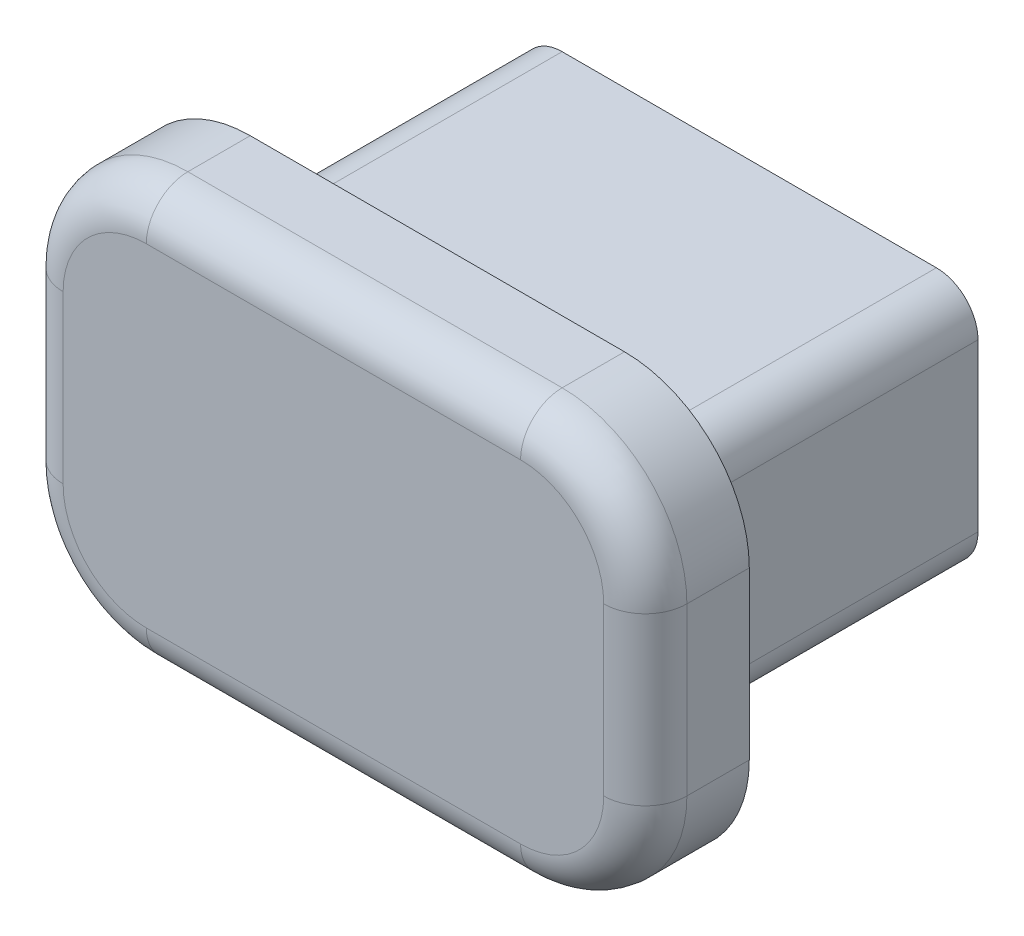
from build123d import *

# Parameters (mm, degrees)
SKETCH1_W          = 15
SKETCH1_H          = 10
EXTRUDE1_DEPTH     = 10
FILLET1_R          = 3
SKETCH2_W          = 15.3259362
SKETCH2_H          = 11.003236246
SKETCH2_W_2        = 11
SKETCH2_H_2        = 6
CUT_EXTRUDE1_DEPTH = 7.5
FILLET2_R          = 1
FILLET3_R          = 1


with BuildPart() as part:
    # Sketch1 → Extrude1 (new body)
    with BuildSketch(Plane.XY):
        Rectangle(SKETCH1_W, SKETCH1_H)
    extrude(amount=EXTRUDE1_DEPTH)

    # Fillet1
    fillet1_edges = [part.edges().sort_by_distance(p)[0] for p in [
        (-7.5, 5, 5),
        (7.5, 5, 5),
        (7.5, -5, 5),
        (-7.5, -5, 5),
    ]]
    fillet(fillet1_edges, radius=FILLET1_R)

    # Sketch2 → Cut-Extrude1 (cut)
    with BuildSketch(Plane(origin=(0, 0, 0), x_dir=(-1, 0, 0), z_dir=(0, 0, -1))):
        with Locations((0.046232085, -0.138696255)):
            Rectangle(SKETCH2_W, SKETCH2_H)
        Rectangle(SKETCH2_W_2, SKETCH2_H_2, mode=Mode.SUBTRACT)
    extrude(amount=-CUT_EXTRUDE1_DEPTH, mode=Mode.SUBTRACT)

    # Fillet2
    fillet2_edges = [part.edges().sort_by_distance(p)[0] for p in [
        (0, -5, 10),
        (-7.5, 0, 10),
        (7.5, 0, 10),
        (0, 5, 10),
        (6.621320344, -4.121320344, 10),
        (6.621320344, 4.121320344, 10),
        (-6.621320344, 4.121320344, 10),
        (-6.621320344, -4.121320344, 10),
    ]]
    fillet(fillet2_edges, radius=FILLET2_R)

    # Fillet3
    fillet3_edges = [part.edges().sort_by_distance(p)[0] for p in [
        (5.5, 3, 3.75),
        (-5.5, 3, 3.75),
        (-5.5, -3, 3.75),
        (5.5, -3, 3.75),
    ]]
    fillet(fillet3_edges, radius=FILLET3_R)


solid = part.part
